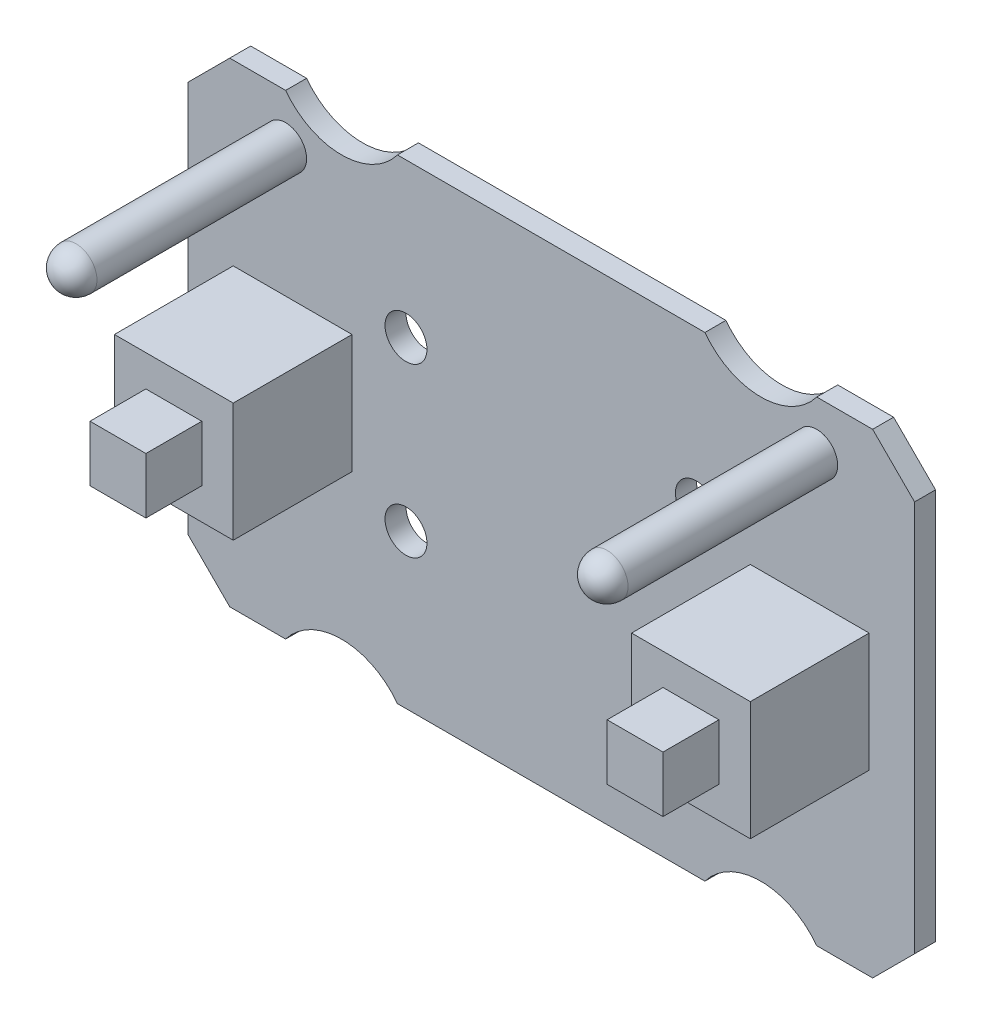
ISO-10303-21;
HEADER;
FILE_DESCRIPTION(('STEP AP214'),'2;1');
FILE_NAME('part.step','',(''),(''),'','','');
FILE_SCHEMA(('AUTOMOTIVE_DESIGN { 1 0 10303 214 1 1 1 1 }'));
ENDSEC;
DATA;
#1=APPLICATION_CONTEXT('core data for automotive mechanical design processes');
#2=APPLICATION_PROTOCOL_DEFINITION('international standard','automotive_design',2000,#1);
#3=PRODUCT_CONTEXT('',#1,'mechanical');
#4=PRODUCT('Part','Part','',(#3));
#5=PRODUCT_RELATED_PRODUCT_CATEGORY('part','',(#4));
#6=PRODUCT_DEFINITION_FORMATION('','',#4);
#7=PRODUCT_DEFINITION_CONTEXT('part definition',#1,'design');
#8=PRODUCT_DEFINITION('design','',#6,#7);
#9=PRODUCT_DEFINITION_SHAPE('','',#8);
#10=(LENGTH_UNIT() NAMED_UNIT(*) SI_UNIT(.MILLI.,.METRE.));
#11=(NAMED_UNIT(*) PLANE_ANGLE_UNIT() SI_UNIT($,.RADIAN.));
#12=(NAMED_UNIT(*) SI_UNIT($,.STERADIAN.) SOLID_ANGLE_UNIT());
#13=UNCERTAINTY_MEASURE_WITH_UNIT(LENGTH_MEASURE(1.E-05),#10,'distance_accuracy_value','');
#14=(GEOMETRIC_REPRESENTATION_CONTEXT(3) GLOBAL_UNCERTAINTY_ASSIGNED_CONTEXT((#13)) GLOBAL_UNIT_ASSIGNED_CONTEXT((#10,
#11,#12)) REPRESENTATION_CONTEXT('',''));
#15=CARTESIAN_POINT('',(0.,0.,0.));
#16=DIRECTION('',(0.,0.,1.));
#17=DIRECTION('',(1.,0.,0.));
#18=AXIS2_PLACEMENT_3D('',#15,#16,#17);
#19=CARTESIAN_POINT('',(-26.,-17.,0.));
#20=DIRECTION('',(0.,0.,1.));
#21=DIRECTION('',(1.,0.,0.));
#22=AXIS2_PLACEMENT_3D('',#19,#20,#21);
#23=PLANE('',#22);
#24=CARTESIAN_POINT('',(-22.5,-12.5,0.));
#25=DIRECTION('',(0.,0.,1.));
#26=DIRECTION('',(1.,0.,0.));
#27=AXIS2_PLACEMENT_3D('',#24,#25,#26);
#28=CIRCLE('',#27,0.3);
#29=CARTESIAN_POINT('',(-22.2,-12.5,0.));
#30=VERTEX_POINT('',#29);
#31=EDGE_CURVE('E504',#30,#30,#28,.F.);
#32=ORIENTED_EDGE('',*,*,#31,.F.);
#33=EDGE_LOOP('',(#32));
#34=FACE_BOUND('',#33,.T.);
#35=CARTESIAN_POINT('',(10.39,6.,0.));
#36=DIRECTION('',(0.,0.,1.));
#37=DIRECTION('',(1.,0.,0.));
#38=AXIS2_PLACEMENT_3D('',#35,#36,#37);
#39=CIRCLE('',#38,1.5);
#40=CARTESIAN_POINT('',(11.89,6.,0.));
#41=VERTEX_POINT('',#40);
#42=EDGE_CURVE('E1043',#41,#41,#39,.T.);
#43=ORIENTED_EDGE('',*,*,#42,.T.);
#44=EDGE_LOOP('',(#43));
#45=FACE_BOUND('',#44,.T.);
#46=CARTESIAN_POINT('',(-10.39,6.,0.));
#47=DIRECTION('',(0.,0.,1.));
#48=DIRECTION('',(1.,0.,0.));
#49=AXIS2_PLACEMENT_3D('',#46,#47,#48);
#50=CIRCLE('',#49,1.5);
#51=CARTESIAN_POINT('',(-8.89,6.,0.));
#52=VERTEX_POINT('',#51);
#53=EDGE_CURVE('E258',#52,#52,#50,.T.);
#54=ORIENTED_EDGE('',*,*,#53,.T.);
#55=EDGE_LOOP('',(#54));
#56=FACE_BOUND('',#55,.T.);
#57=DIRECTION('',(1.,0.,0.));
#58=VECTOR('',#57,1.);
#59=CARTESIAN_POINT('',(-26.,-17.,0.));
#60=LINE('',#59,#58);
#61=CARTESIAN_POINT('',(19.,-17.,0.));
#62=VERTEX_POINT('',#61);
#63=CARTESIAN_POINT('',(23.,-17.,0.));
#64=VERTEX_POINT('',#63);
#65=EDGE_CURVE('E417',#62,#64,#60,.T.);
#66=ORIENTED_EDGE('',*,*,#65,.F.);
#67=CARTESIAN_POINT('',(15.,-20.,0.));
#68=DIRECTION('',(0.,0.,1.));
#69=DIRECTION('',(1.,0.,0.));
#70=AXIS2_PLACEMENT_3D('',#67,#68,#69);
#71=CIRCLE('',#70,5.);
#72=CARTESIAN_POINT('',(11.,-17.,0.));
#73=VERTEX_POINT('',#72);
#74=EDGE_CURVE('E371',#62,#73,#71,.T.);
#75=ORIENTED_EDGE('',*,*,#74,.T.);
#76=CARTESIAN_POINT('',(-11.,-17.,0.));
#77=VERTEX_POINT('',#76);
#78=EDGE_CURVE('E422',#77,#73,#60,.T.);
#79=ORIENTED_EDGE('',*,*,#78,.F.);
#80=CARTESIAN_POINT('',(-15.,-20.,0.));
#81=DIRECTION('',(0.,0.,1.));
#82=DIRECTION('',(1.,0.,0.));
#83=AXIS2_PLACEMENT_3D('',#80,#81,#82);
#84=CIRCLE('',#83,5.);
#85=CARTESIAN_POINT('',(-19.,-17.,0.));
#86=VERTEX_POINT('',#85);
#87=EDGE_CURVE('E382',#77,#86,#84,.T.);
#88=ORIENTED_EDGE('',*,*,#87,.T.);
#89=CARTESIAN_POINT('',(-23.,-17.,0.));
#90=VERTEX_POINT('',#89);
#91=EDGE_CURVE('E418',#90,#86,#60,.T.);
#92=ORIENTED_EDGE('',*,*,#91,.F.);
#93=DIRECTION('',(0.707106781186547,-0.707106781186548,0.));
#94=VECTOR('',#93,1.);
#95=CARTESIAN_POINT('',(-23.,-17.,0.));
#96=LINE('',#95,#94);
#97=CARTESIAN_POINT('',(-26.,-14.,0.));
#98=VERTEX_POINT('',#97);
#99=EDGE_CURVE('E460',#90,#98,#96,.F.);
#100=ORIENTED_EDGE('',*,*,#99,.T.);
#101=DIRECTION('',(0.,-1.,0.));
#102=VECTOR('',#101,1.);
#103=CARTESIAN_POINT('',(-26.,17.,0.));
#104=LINE('',#103,#102);
#105=CARTESIAN_POINT('',(-26.,14.,0.));
#106=VERTEX_POINT('',#105);
#107=EDGE_CURVE('E414',#106,#98,#104,.T.);
#108=ORIENTED_EDGE('',*,*,#107,.F.);
#109=DIRECTION('',(-0.707106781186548,-0.707106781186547,0.));
#110=VECTOR('',#109,1.);
#111=CARTESIAN_POINT('',(-26.,14.,0.));
#112=LINE('',#111,#110);
#113=CARTESIAN_POINT('',(-23.,17.,0.));
#114=VERTEX_POINT('',#113);
#115=EDGE_CURVE('E457',#106,#114,#112,.F.);
#116=ORIENTED_EDGE('',*,*,#115,.T.);
#117=DIRECTION('',(-1.,0.,0.));
#118=VECTOR('',#117,1.);
#119=CARTESIAN_POINT('',(-26.,17.,0.));
#120=LINE('',#119,#118);
#121=CARTESIAN_POINT('',(-19.,17.,0.));
#122=VERTEX_POINT('',#121);
#123=EDGE_CURVE('E425',#122,#114,#120,.T.);
#124=ORIENTED_EDGE('',*,*,#123,.F.);
#125=CARTESIAN_POINT('',(-15.,20.,0.));
#126=DIRECTION('',(0.,0.,1.));
#127=DIRECTION('',(1.,0.,0.));
#128=AXIS2_PLACEMENT_3D('',#125,#126,#127);
#129=CIRCLE('',#128,5.);
#130=CARTESIAN_POINT('',(-11.,17.,0.));
#131=VERTEX_POINT('',#130);
#132=EDGE_CURVE('E405',#122,#131,#129,.T.);
#133=ORIENTED_EDGE('',*,*,#132,.T.);
#134=CARTESIAN_POINT('',(11.,17.,0.));
#135=VERTEX_POINT('',#134);
#136=EDGE_CURVE('E430',#135,#131,#120,.T.);
#137=ORIENTED_EDGE('',*,*,#136,.F.);
#138=CARTESIAN_POINT('',(15.,20.,0.));
#139=DIRECTION('',(0.,0.,1.));
#140=DIRECTION('',(1.,0.,0.));
#141=AXIS2_PLACEMENT_3D('',#138,#139,#140);
#142=CIRCLE('',#141,5.);
#143=CARTESIAN_POINT('',(19.,17.,0.));
#144=VERTEX_POINT('',#143);
#145=EDGE_CURVE('E393',#135,#144,#142,.T.);
#146=ORIENTED_EDGE('',*,*,#145,.T.);
#147=CARTESIAN_POINT('',(23.,17.,0.));
#148=VERTEX_POINT('',#147);
#149=EDGE_CURVE('E426',#148,#144,#120,.T.);
#150=ORIENTED_EDGE('',*,*,#149,.F.);
#151=DIRECTION('',(-0.707106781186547,0.707106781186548,0.));
#152=VECTOR('',#151,1.);
#153=CARTESIAN_POINT('',(23.,17.,0.));
#154=LINE('',#153,#152);
#155=CARTESIAN_POINT('',(26.,14.,0.));
#156=VERTEX_POINT('',#155);
#157=EDGE_CURVE('E452',#148,#156,#154,.F.);
#158=ORIENTED_EDGE('',*,*,#157,.T.);
#159=DIRECTION('',(0.,1.,0.));
#160=VECTOR('',#159,1.);
#161=CARTESIAN_POINT('',(26.,17.,0.));
#162=LINE('',#161,#160);
#163=CARTESIAN_POINT('',(26.,-14.,0.));
#164=VERTEX_POINT('',#163);
#165=EDGE_CURVE('E421',#164,#156,#162,.T.);
#166=ORIENTED_EDGE('',*,*,#165,.F.);
#167=DIRECTION('',(0.707106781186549,0.707106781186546,0.));
#168=VECTOR('',#167,1.);
#169=CARTESIAN_POINT('',(26.,-14.,0.));
#170=LINE('',#169,#168);
#171=EDGE_CURVE('E454',#164,#64,#170,.F.);
#172=ORIENTED_EDGE('',*,*,#171,.T.);
#173=EDGE_LOOP('',(#66,#75,#79,#88,#92,#100,#108,#116,#124,#133,#137,#146,#150,#158,#166,#172));
#174=FACE_BOUND('',#173,.T.);
#175=CARTESIAN_POINT('',(-10.39,-6.,0.));
#176=DIRECTION('',(0.,0.,1.));
#177=DIRECTION('',(1.,0.,0.));
#178=AXIS2_PLACEMENT_3D('',#175,#176,#177);
#179=CIRCLE('',#178,1.5);
#180=CARTESIAN_POINT('',(-8.89,-6.,0.));
#181=VERTEX_POINT('',#180);
#182=EDGE_CURVE('E492',#181,#181,#179,.T.);
#183=ORIENTED_EDGE('',*,*,#182,.T.);
#184=EDGE_LOOP('',(#183));
#185=FACE_BOUND('',#184,.T.);
#186=CARTESIAN_POINT('',(10.39,-6.,0.));
#187=DIRECTION('',(0.,0.,1.));
#188=DIRECTION('',(1.,0.,0.));
#189=AXIS2_PLACEMENT_3D('',#186,#187,#188);
#190=CIRCLE('',#189,1.5);
#191=CARTESIAN_POINT('',(11.89,-6.,0.));
#192=VERTEX_POINT('',#191);
#193=EDGE_CURVE('E498',#192,#192,#190,.T.);
#194=ORIENTED_EDGE('',*,*,#193,.T.);
#195=EDGE_LOOP('',(#194));
#196=FACE_BOUND('',#195,.T.);
#197=CARTESIAN_POINT('',(-22.5,-10.5,0.));
#198=DIRECTION('',(0.,0.,1.));
#199=DIRECTION('',(1.,0.,0.));
#200=AXIS2_PLACEMENT_3D('',#197,#198,#199);
#201=CIRCLE('',#200,0.3);
#202=CARTESIAN_POINT('',(-22.2,-10.5,0.));
#203=VERTEX_POINT('',#202);
#204=EDGE_CURVE('E507',#203,#203,#201,.F.);
#205=ORIENTED_EDGE('',*,*,#204,.F.);
#206=EDGE_LOOP('',(#205));
#207=FACE_BOUND('',#206,.T.);
#208=CARTESIAN_POINT('',(-22.5,-8.5,0.));
#209=DIRECTION('',(0.,0.,1.));
#210=DIRECTION('',(1.,0.,0.));
#211=AXIS2_PLACEMENT_3D('',#208,#209,#210);
#212=CIRCLE('',#211,0.3);
#213=CARTESIAN_POINT('',(-22.2,-8.5,0.));
#214=VERTEX_POINT('',#213);
#215=EDGE_CURVE('E510',#214,#214,#212,.F.);
#216=ORIENTED_EDGE('',*,*,#215,.F.);
#217=EDGE_LOOP('',(#216));
#218=FACE_BOUND('',#217,.T.);
#219=CARTESIAN_POINT('',(-22.5,-6.5,0.));
#220=DIRECTION('',(0.,0.,1.));
#221=DIRECTION('',(1.,0.,0.));
#222=AXIS2_PLACEMENT_3D('',#219,#220,#221);
#223=CIRCLE('',#222,0.3);
#224=CARTESIAN_POINT('',(-22.2,-6.5,0.));
#225=VERTEX_POINT('',#224);
#226=EDGE_CURVE('E34',#225,#225,#223,.F.);
#227=ORIENTED_EDGE('',*,*,#226,.F.);
#228=EDGE_LOOP('',(#227));
#229=FACE_BOUND('',#228,.T.);
#230=ADVANCED_FACE('F26',(#34,#45,#56,#174,#185,#196,#207,#218,#229),#23,.F.);
#231=CARTESIAN_POINT('',(14.25,-4.25,10.));
#232=DIRECTION('',(0.,0.,1.));
#233=DIRECTION('',(1.,0.,0.));
#234=AXIS2_PLACEMENT_3D('',#231,#232,#233);
#235=PLANE('',#234);
#236=DIRECTION('',(0.,-1.,0.));
#237=VECTOR('',#236,1.);
#238=CARTESIAN_POINT('',(14.25,4.25,10.));
#239=LINE('',#238,#237);
#240=CARTESIAN_POINT('',(14.25,4.25,10.));
#241=VERTEX_POINT('',#240);
#242=CARTESIAN_POINT('',(14.25,-4.25,10.));
#243=VERTEX_POINT('',#242);
#244=EDGE_CURVE('E287',#241,#243,#239,.T.);
#245=ORIENTED_EDGE('',*,*,#244,.T.);
#246=DIRECTION('',(1.,0.,0.));
#247=VECTOR('',#246,1.);
#248=CARTESIAN_POINT('',(14.25,-4.25,10.));
#249=LINE('',#248,#247);
#250=CARTESIAN_POINT('',(22.75,-4.25,10.));
#251=VERTEX_POINT('',#250);
#252=EDGE_CURVE('E290',#243,#251,#249,.T.);
#253=ORIENTED_EDGE('',*,*,#252,.T.);
#254=DIRECTION('',(0.,1.,0.));
#255=VECTOR('',#254,1.);
#256=CARTESIAN_POINT('',(22.75,4.25,10.));
#257=LINE('',#256,#255);
#258=CARTESIAN_POINT('',(22.75,4.25,10.));
#259=VERTEX_POINT('',#258);
#260=EDGE_CURVE('E292',#251,#259,#257,.T.);
#261=ORIENTED_EDGE('',*,*,#260,.T.);
#262=DIRECTION('',(-1.,0.,0.));
#263=VECTOR('',#262,1.);
#264=CARTESIAN_POINT('',(14.25,4.25,10.));
#265=LINE('',#264,#263);
#266=EDGE_CURVE('E294',#259,#241,#265,.T.);
#267=ORIENTED_EDGE('',*,*,#266,.T.);
#268=EDGE_LOOP('',(#245,#253,#261,#267));
#269=FACE_BOUND('',#268,.T.);
#270=DIRECTION('',(1.,0.,0.));
#271=VECTOR('',#270,1.);
#272=CARTESIAN_POINT('',(16.5,-2.,10.));
#273=LINE('',#272,#271);
#274=CARTESIAN_POINT('',(16.5,-2.,10.));
#275=VERTEX_POINT('',#274);
#276=CARTESIAN_POINT('',(20.5,-2.,10.));
#277=VERTEX_POINT('',#276);
#278=EDGE_CURVE('E241',#275,#277,#273,.T.);
#279=ORIENTED_EDGE('',*,*,#278,.F.);
#280=DIRECTION('',(0.,-1.,0.));
#281=VECTOR('',#280,1.);
#282=CARTESIAN_POINT('',(16.5,2.,10.));
#283=LINE('',#282,#281);
#284=CARTESIAN_POINT('',(16.5,2.,10.));
#285=VERTEX_POINT('',#284);
#286=EDGE_CURVE('E252',#285,#275,#283,.T.);
#287=ORIENTED_EDGE('',*,*,#286,.F.);
#288=DIRECTION('',(-1.,0.,0.));
#289=VECTOR('',#288,1.);
#290=CARTESIAN_POINT('',(16.5,2.,10.));
#291=LINE('',#290,#289);
#292=CARTESIAN_POINT('',(20.5,2.,10.));
#293=VERTEX_POINT('',#292);
#294=EDGE_CURVE('E264',#293,#285,#291,.T.);
#295=ORIENTED_EDGE('',*,*,#294,.F.);
#296=DIRECTION('',(0.,1.,0.));
#297=VECTOR('',#296,1.);
#298=CARTESIAN_POINT('',(20.5,2.,10.));
#299=LINE('',#298,#297);
#300=EDGE_CURVE('E262',#277,#293,#299,.T.);
#301=ORIENTED_EDGE('',*,*,#300,.F.);
#302=EDGE_LOOP('',(#279,#287,#295,#301));
#303=FACE_BOUND('',#302,.T.);
#304=ADVANCED_FACE('F261',(#269,#303),#235,.T.);
#305=CARTESIAN_POINT('',(-26.,-17.,1.5));
#306=DIRECTION('',(0.,0.,1.));
#307=DIRECTION('',(1.,0.,0.));
#308=AXIS2_PLACEMENT_3D('',#305,#306,#307);
#309=PLANE('',#308);
#310=CARTESIAN_POINT('',(10.39,6.,1.5));
#311=DIRECTION('',(0.,0.,1.));
#312=DIRECTION('',(1.,0.,0.));
#313=AXIS2_PLACEMENT_3D('',#310,#311,#312);
#314=CIRCLE('',#313,1.5);
#315=CARTESIAN_POINT('',(11.89,6.,1.5));
#316=VERTEX_POINT('',#315);
#317=EDGE_CURVE('E1040',#316,#316,#314,.T.);
#318=ORIENTED_EDGE('',*,*,#317,.F.);
#319=EDGE_LOOP('',(#318));
#320=FACE_BOUND('',#319,.T.);
#321=CARTESIAN_POINT('',(-10.39,6.,1.5));
#322=DIRECTION('',(0.,0.,1.));
#323=DIRECTION('',(1.,0.,0.));
#324=AXIS2_PLACEMENT_3D('',#321,#322,#323);
#325=CIRCLE('',#324,1.5);
#326=CARTESIAN_POINT('',(-8.89,6.,1.5));
#327=VERTEX_POINT('',#326);
#328=EDGE_CURVE('E1038',#327,#327,#325,.T.);
#329=ORIENTED_EDGE('',*,*,#328,.F.);
#330=EDGE_LOOP('',(#329));
#331=FACE_BOUND('',#330,.T.);
#332=DIRECTION('',(1.,0.,0.));
#333=VECTOR('',#332,1.);
#334=CARTESIAN_POINT('',(-22.75,-4.25,1.5));
#335=LINE('',#334,#333);
#336=CARTESIAN_POINT('',(-22.75,-4.25,1.5));
#337=VERTEX_POINT('',#336);
#338=CARTESIAN_POINT('',(-14.25,-4.25,1.5));
#339=VERTEX_POINT('',#338);
#340=EDGE_CURVE('E337',#337,#339,#335,.T.);
#341=ORIENTED_EDGE('',*,*,#340,.F.);
#342=DIRECTION('',(0.,-1.,0.));
#343=VECTOR('',#342,1.);
#344=CARTESIAN_POINT('',(-22.75,4.25,1.5));
#345=LINE('',#344,#343);
#346=CARTESIAN_POINT('',(-22.75,4.25,1.5));
#347=VERTEX_POINT('',#346);
#348=EDGE_CURVE('E334',#347,#337,#345,.T.);
#349=ORIENTED_EDGE('',*,*,#348,.F.);
#350=DIRECTION('',(-1.,0.,0.));
#351=VECTOR('',#350,1.);
#352=CARTESIAN_POINT('',(-22.75,4.25,1.5));
#353=LINE('',#352,#351);
#354=CARTESIAN_POINT('',(-14.25,4.25,1.5));
#355=VERTEX_POINT('',#354);
#356=EDGE_CURVE('E342',#355,#347,#353,.T.);
#357=ORIENTED_EDGE('',*,*,#356,.F.);
#358=DIRECTION('',(0.,1.,0.));
#359=VECTOR('',#358,1.);
#360=CARTESIAN_POINT('',(-14.25,4.25,1.5));
#361=LINE('',#360,#359);
#362=EDGE_CURVE('E339',#339,#355,#361,.T.);
#363=ORIENTED_EDGE('',*,*,#362,.F.);
#364=EDGE_LOOP('',(#341,#349,#357,#363));
#365=FACE_BOUND('',#364,.T.);
#366=CARTESIAN_POINT('',(-19.,13.5,1.5));
#367=DIRECTION('',(0.,0.,1.));
#368=DIRECTION('',(1.,0.,0.));
#369=AXIS2_PLACEMENT_3D('',#366,#367,#368);
#370=CIRCLE('',#369,1.5);
#371=CARTESIAN_POINT('',(-17.5,13.5,1.5));
#372=VERTEX_POINT('',#371);
#373=EDGE_CURVE('E366',#372,#372,#370,.T.);
#374=ORIENTED_EDGE('',*,*,#373,.F.);
#375=EDGE_LOOP('',(#374));
#376=FACE_BOUND('',#375,.T.);
#377=CARTESIAN_POINT('',(15.,-20.,1.5));
#378=DIRECTION('',(0.,0.,1.));
#379=DIRECTION('',(1.,0.,0.));
#380=AXIS2_PLACEMENT_3D('',#377,#378,#379);
#381=CIRCLE('',#380,5.);
#382=CARTESIAN_POINT('',(19.,-17.,1.5));
#383=VERTEX_POINT('',#382);
#384=CARTESIAN_POINT('',(11.,-17.,1.5));
#385=VERTEX_POINT('',#384);
#386=EDGE_CURVE('E369',#383,#385,#381,.T.);
#387=ORIENTED_EDGE('',*,*,#386,.F.);
#388=DIRECTION('',(1.,0.,0.));
#389=VECTOR('',#388,1.);
#390=CARTESIAN_POINT('',(-26.,-17.,1.5));
#391=LINE('',#390,#389);
#392=CARTESIAN_POINT('',(23.,-17.,1.5));
#393=VERTEX_POINT('',#392);
#394=EDGE_CURVE('E433',#383,#393,#391,.T.);
#395=ORIENTED_EDGE('',*,*,#394,.T.);
#396=DIRECTION('',(-0.707106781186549,-0.707106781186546,0.));
#397=VECTOR('',#396,1.);
#398=CARTESIAN_POINT('',(-1.50000000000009,-41.5,1.5));
#399=LINE('',#398,#397);
#400=CARTESIAN_POINT('',(26.,-14.,1.5));
#401=VERTEX_POINT('',#400);
#402=EDGE_CURVE('E469',#393,#401,#399,.F.);
#403=ORIENTED_EDGE('',*,*,#402,.T.);
#404=DIRECTION('',(0.,1.,0.));
#405=VECTOR('',#404,1.);
#406=CARTESIAN_POINT('',(26.,17.,1.5));
#407=LINE('',#406,#405);
#408=CARTESIAN_POINT('',(26.,14.,1.5));
#409=VERTEX_POINT('',#408);
#410=EDGE_CURVE('E437',#401,#409,#407,.T.);
#411=ORIENTED_EDGE('',*,*,#410,.T.);
#412=DIRECTION('',(0.707106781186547,-0.707106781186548,0.));
#413=VECTOR('',#412,1.);
#414=CARTESIAN_POINT('',(15.5000000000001,24.5,1.5));
#415=LINE('',#414,#413);
#416=CARTESIAN_POINT('',(23.,17.,1.5));
#417=VERTEX_POINT('',#416);
#418=EDGE_CURVE('E467',#409,#417,#415,.F.);
#419=ORIENTED_EDGE('',*,*,#418,.T.);
#420=DIRECTION('',(-1.,0.,0.));
#421=VECTOR('',#420,1.);
#422=CARTESIAN_POINT('',(-26.,17.,1.5));
#423=LINE('',#422,#421);
#424=CARTESIAN_POINT('',(19.,17.,1.5));
#425=VERTEX_POINT('',#424);
#426=EDGE_CURVE('E442',#417,#425,#423,.T.);
#427=ORIENTED_EDGE('',*,*,#426,.T.);
#428=CARTESIAN_POINT('',(15.,20.,1.5));
#429=DIRECTION('',(0.,0.,1.));
#430=DIRECTION('',(1.,0.,0.));
#431=AXIS2_PLACEMENT_3D('',#428,#429,#430);
#432=CIRCLE('',#431,5.);
#433=CARTESIAN_POINT('',(11.,17.,1.5));
#434=VERTEX_POINT('',#433);
#435=EDGE_CURVE('E391',#434,#425,#432,.T.);
#436=ORIENTED_EDGE('',*,*,#435,.F.);
#437=CARTESIAN_POINT('',(-11.,17.,1.5));
#438=VERTEX_POINT('',#437);
#439=EDGE_CURVE('E446',#434,#438,#423,.T.);
#440=ORIENTED_EDGE('',*,*,#439,.T.);
#441=CARTESIAN_POINT('',(-15.,20.,1.5));
#442=DIRECTION('',(0.,0.,1.));
#443=DIRECTION('',(1.,0.,0.));
#444=AXIS2_PLACEMENT_3D('',#441,#442,#443);
#445=CIRCLE('',#444,5.);
#446=CARTESIAN_POINT('',(-19.,17.,1.5));
#447=VERTEX_POINT('',#446);
#448=EDGE_CURVE('E402',#447,#438,#445,.T.);
#449=ORIENTED_EDGE('',*,*,#448,.F.);
#450=CARTESIAN_POINT('',(-23.,17.,1.5));
#451=VERTEX_POINT('',#450);
#452=EDGE_CURVE('E441',#447,#451,#423,.T.);
#453=ORIENTED_EDGE('',*,*,#452,.T.);
#454=DIRECTION('',(0.707106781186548,0.707106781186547,0.));
#455=VECTOR('',#454,1.);
#456=CARTESIAN_POINT('',(-41.5,-1.49999999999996,1.5));
#457=LINE('',#456,#455);
#458=CARTESIAN_POINT('',(-26.,14.,1.5));
#459=VERTEX_POINT('',#458);
#460=EDGE_CURVE('E471',#451,#459,#457,.F.);
#461=ORIENTED_EDGE('',*,*,#460,.T.);
#462=DIRECTION('',(0.,-1.,0.));
#463=VECTOR('',#462,1.);
#464=CARTESIAN_POINT('',(-26.,17.,1.5));
#465=LINE('',#464,#463);
#466=CARTESIAN_POINT('',(-26.,-14.,1.5));
#467=VERTEX_POINT('',#466);
#468=EDGE_CURVE('E429',#459,#467,#465,.T.);
#469=ORIENTED_EDGE('',*,*,#468,.T.);
#470=DIRECTION('',(-0.707106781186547,0.707106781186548,0.));
#471=VECTOR('',#470,1.);
#472=CARTESIAN_POINT('',(-24.5,-15.5,1.5));
#473=LINE('',#472,#471);
#474=CARTESIAN_POINT('',(-23.,-17.,1.5));
#475=VERTEX_POINT('',#474);
#476=EDGE_CURVE('E473',#467,#475,#473,.F.);
#477=ORIENTED_EDGE('',*,*,#476,.T.);
#478=CARTESIAN_POINT('',(-19.,-17.,1.5));
#479=VERTEX_POINT('',#478);
#480=EDGE_CURVE('E434',#475,#479,#391,.T.);
#481=ORIENTED_EDGE('',*,*,#480,.T.);
#482=CARTESIAN_POINT('',(-15.,-20.,1.5));
#483=DIRECTION('',(0.,0.,1.));
#484=DIRECTION('',(1.,0.,0.));
#485=AXIS2_PLACEMENT_3D('',#482,#483,#484);
#486=CIRCLE('',#485,5.);
#487=CARTESIAN_POINT('',(-11.,-17.,1.5));
#488=VERTEX_POINT('',#487);
#489=EDGE_CURVE('E380',#488,#479,#486,.T.);
#490=ORIENTED_EDGE('',*,*,#489,.F.);
#491=EDGE_CURVE('E438',#488,#385,#391,.T.);
#492=ORIENTED_EDGE('',*,*,#491,.T.);
#493=EDGE_LOOP('',(#387,#395,#403,#411,#419,#427,#436,#440,#449,#453,#461,#469,#477,#481,#490,#492));
#494=FACE_BOUND('',#493,.T.);
#495=CARTESIAN_POINT('',(19.,13.5,1.5));
#496=DIRECTION('',(0.,0.,1.));
#497=DIRECTION('',(1.,0.,0.));
#498=AXIS2_PLACEMENT_3D('',#495,#496,#497);
#499=CIRCLE('',#498,1.5);
#500=CARTESIAN_POINT('',(20.5,13.5,1.5));
#501=VERTEX_POINT('',#500);
#502=EDGE_CURVE('E363',#501,#501,#499,.T.);
#503=ORIENTED_EDGE('',*,*,#502,.F.);
#504=EDGE_LOOP('',(#503));
#505=FACE_BOUND('',#504,.T.);
#506=DIRECTION('',(1.,0.,0.));
#507=VECTOR('',#506,1.);
#508=CARTESIAN_POINT('',(14.25,-4.25,1.5));
#509=LINE('',#508,#507);
#510=CARTESIAN_POINT('',(14.25,-4.25,1.5));
#511=VERTEX_POINT('',#510);
#512=CARTESIAN_POINT('',(22.75,-4.25,1.5));
#513=VERTEX_POINT('',#512);
#514=EDGE_CURVE('E281',#511,#513,#509,.T.);
#515=ORIENTED_EDGE('',*,*,#514,.F.);
#516=DIRECTION('',(0.,-1.,0.));
#517=VECTOR('',#516,1.);
#518=CARTESIAN_POINT('',(14.25,4.25,1.5));
#519=LINE('',#518,#517);
#520=CARTESIAN_POINT('',(14.25,4.25,1.5));
#521=VERTEX_POINT('',#520);
#522=EDGE_CURVE('E247',#521,#511,#519,.T.);
#523=ORIENTED_EDGE('',*,*,#522,.F.);
#524=DIRECTION('',(-1.,0.,0.));
#525=VECTOR('',#524,1.);
#526=CARTESIAN_POINT('',(14.25,4.25,1.5));
#527=LINE('',#526,#525);
#528=CARTESIAN_POINT('',(22.75,4.25,1.5));
#529=VERTEX_POINT('',#528);
#530=EDGE_CURVE('E285',#529,#521,#527,.T.);
#531=ORIENTED_EDGE('',*,*,#530,.F.);
#532=DIRECTION('',(0.,1.,0.));
#533=VECTOR('',#532,1.);
#534=CARTESIAN_POINT('',(22.75,4.25,1.5));
#535=LINE('',#534,#533);
#536=EDGE_CURVE('E283',#513,#529,#535,.T.);
#537=ORIENTED_EDGE('',*,*,#536,.F.);
#538=EDGE_LOOP('',(#515,#523,#531,#537));
#539=FACE_BOUND('',#538,.T.);
#540=CARTESIAN_POINT('',(-10.39,-6.,1.5));
#541=DIRECTION('',(0.,0.,1.));
#542=DIRECTION('',(1.,0.,0.));
#543=AXIS2_PLACEMENT_3D('',#540,#541,#542);
#544=CIRCLE('',#543,1.5);
#545=CARTESIAN_POINT('',(-8.89,-6.,1.5));
#546=VERTEX_POINT('',#545);
#547=EDGE_CURVE('E495',#546,#546,#544,.T.);
#548=ORIENTED_EDGE('',*,*,#547,.F.);
#549=EDGE_LOOP('',(#548));
#550=FACE_BOUND('',#549,.T.);
#551=CARTESIAN_POINT('',(10.39,-6.,1.5));
#552=DIRECTION('',(0.,0.,1.));
#553=DIRECTION('',(1.,0.,0.));
#554=AXIS2_PLACEMENT_3D('',#551,#552,#553);
#555=CIRCLE('',#554,1.5);
#556=CARTESIAN_POINT('',(11.89,-6.,1.5));
#557=VERTEX_POINT('',#556);
#558=EDGE_CURVE('E501',#557,#557,#555,.T.);
#559=ORIENTED_EDGE('',*,*,#558,.F.);
#560=EDGE_LOOP('',(#559));
#561=FACE_BOUND('',#560,.T.);
#562=ADVANCED_FACE('F528',(#320,#331,#365,#376,#494,#505,#539,#550,#561),#309,.T.);
#563=CARTESIAN_POINT('',(-22.75,-4.25,10.));
#564=DIRECTION('',(0.,0.,1.));
#565=DIRECTION('',(1.,0.,0.));
#566=AXIS2_PLACEMENT_3D('',#563,#564,#565);
#567=PLANE('',#566);
#568=DIRECTION('',(0.,-1.,0.));
#569=VECTOR('',#568,1.);
#570=CARTESIAN_POINT('',(-22.75,4.25,10.));
#571=LINE('',#570,#569);
#572=CARTESIAN_POINT('',(-22.75,4.25,10.));
#573=VERTEX_POINT('',#572);
#574=CARTESIAN_POINT('',(-22.75,-4.25,10.));
#575=VERTEX_POINT('',#574);
#576=EDGE_CURVE('E344',#573,#575,#571,.T.);
#577=ORIENTED_EDGE('',*,*,#576,.T.);
#578=DIRECTION('',(1.,0.,0.));
#579=VECTOR('',#578,1.);
#580=CARTESIAN_POINT('',(-22.75,-4.25,10.));
#581=LINE('',#580,#579);
#582=CARTESIAN_POINT('',(-14.25,-4.25,10.));
#583=VERTEX_POINT('',#582);
#584=EDGE_CURVE('E347',#575,#583,#581,.T.);
#585=ORIENTED_EDGE('',*,*,#584,.T.);
#586=DIRECTION('',(0.,1.,0.));
#587=VECTOR('',#586,1.);
#588=CARTESIAN_POINT('',(-14.25,4.25,10.));
#589=LINE('',#588,#587);
#590=CARTESIAN_POINT('',(-14.25,4.25,10.));
#591=VERTEX_POINT('',#590);
#592=EDGE_CURVE('E349',#583,#591,#589,.T.);
#593=ORIENTED_EDGE('',*,*,#592,.T.);
#594=DIRECTION('',(-1.,0.,0.));
#595=VECTOR('',#594,1.);
#596=CARTESIAN_POINT('',(-22.75,4.25,10.));
#597=LINE('',#596,#595);
#598=EDGE_CURVE('E351',#591,#573,#597,.T.);
#599=ORIENTED_EDGE('',*,*,#598,.T.);
#600=EDGE_LOOP('',(#577,#585,#593,#599));
#601=FACE_BOUND('',#600,.T.);
#602=DIRECTION('',(1.,0.,0.));
#603=VECTOR('',#602,1.);
#604=CARTESIAN_POINT('',(-20.5,-2.,10.));
#605=LINE('',#604,#603);
#606=CARTESIAN_POINT('',(-20.5,-2.,10.));
#607=VERTEX_POINT('',#606);
#608=CARTESIAN_POINT('',(-16.5,-2.,10.));
#609=VERTEX_POINT('',#608);
#610=EDGE_CURVE('E308',#607,#609,#605,.T.);
#611=ORIENTED_EDGE('',*,*,#610,.F.);
#612=DIRECTION('',(0.,-1.,0.));
#613=VECTOR('',#612,1.);
#614=CARTESIAN_POINT('',(-20.5,2.,10.));
#615=LINE('',#614,#613);
#616=CARTESIAN_POINT('',(-20.5,2.,10.));
#617=VERTEX_POINT('',#616);
#618=EDGE_CURVE('E305',#617,#607,#615,.T.);
#619=ORIENTED_EDGE('',*,*,#618,.F.);
#620=DIRECTION('',(-1.,0.,0.));
#621=VECTOR('',#620,1.);
#622=CARTESIAN_POINT('',(-20.5,2.,10.));
#623=LINE('',#622,#621);
#624=CARTESIAN_POINT('',(-16.5,2.,10.));
#625=VERTEX_POINT('',#624);
#626=EDGE_CURVE('E313',#625,#617,#623,.T.);
#627=ORIENTED_EDGE('',*,*,#626,.F.);
#628=DIRECTION('',(0.,1.,0.));
#629=VECTOR('',#628,1.);
#630=CARTESIAN_POINT('',(-16.5,2.,10.));
#631=LINE('',#630,#629);
#632=EDGE_CURVE('E310',#609,#625,#631,.T.);
#633=ORIENTED_EDGE('',*,*,#632,.F.);
#634=EDGE_LOOP('',(#611,#619,#627,#633));
#635=FACE_BOUND('',#634,.T.);
#636=ADVANCED_FACE('F539',(#601,#635),#567,.T.);
#637=CARTESIAN_POINT('',(-26.,-17.,1.5));
#638=DIRECTION('',(0.,1.,0.));
#639=DIRECTION('',(0.,0.,1.));
#640=AXIS2_PLACEMENT_3D('',#637,#638,#639);
#641=PLANE('',#640);
#642=ORIENTED_EDGE('',*,*,#78,.T.);
#643=DIRECTION('',(0.,0.,1.));
#644=VECTOR('',#643,1.);
#645=CARTESIAN_POINT('',(11.,-17.,0.));
#646=LINE('',#645,#644);
#647=EDGE_CURVE('E377',#73,#385,#646,.T.);
#648=ORIENTED_EDGE('',*,*,#647,.T.);
#649=ORIENTED_EDGE('',*,*,#491,.F.);
#650=DIRECTION('',(0.,0.,1.));
#651=VECTOR('',#650,1.);
#652=CARTESIAN_POINT('',(-11.,-17.,0.));
#653=LINE('',#652,#651);
#654=EDGE_CURVE('E385',#488,#77,#653,.F.);
#655=ORIENTED_EDGE('',*,*,#654,.T.);
#656=EDGE_LOOP('',(#642,#648,#649,#655));
#657=FACE_BOUND('',#656,.T.);
#658=ADVANCED_FACE('F556',(#657),#641,.F.);
#659=ORIENTED_EDGE('',*,*,#91,.T.);
#660=DIRECTION('',(0.,0.,1.));
#661=VECTOR('',#660,1.);
#662=CARTESIAN_POINT('',(-19.,-17.,0.));
#663=LINE('',#662,#661);
#664=EDGE_CURVE('E388',#86,#479,#663,.T.);
#665=ORIENTED_EDGE('',*,*,#664,.T.);
#666=ORIENTED_EDGE('',*,*,#480,.F.);
#667=DIRECTION('',(0.,0.,-1.));
#668=VECTOR('',#667,1.);
#669=CARTESIAN_POINT('',(-23.,-17.,1.5));
#670=LINE('',#669,#668);
#671=EDGE_CURVE('E449',#475,#90,#670,.T.);
#672=ORIENTED_EDGE('',*,*,#671,.T.);
#673=EDGE_LOOP('',(#659,#665,#666,#672));
#674=FACE_BOUND('',#673,.T.);
#675=ADVANCED_FACE('F557',(#674),#641,.F.);
#676=CARTESIAN_POINT('',(-26.,17.,1.5));
#677=DIRECTION('',(0.,-1.,0.));
#678=DIRECTION('',(0.,0.,-1.));
#679=AXIS2_PLACEMENT_3D('',#676,#677,#678);
#680=PLANE('',#679);
#681=ORIENTED_EDGE('',*,*,#149,.T.);
#682=DIRECTION('',(0.,0.,1.));
#683=VECTOR('',#682,1.);
#684=CARTESIAN_POINT('',(19.,17.,0.));
#685=LINE('',#684,#683);
#686=EDGE_CURVE('E399',#144,#425,#685,.T.);
#687=ORIENTED_EDGE('',*,*,#686,.T.);
#688=ORIENTED_EDGE('',*,*,#426,.F.);
#689=DIRECTION('',(0.,0.,-1.));
#690=VECTOR('',#689,1.);
#691=CARTESIAN_POINT('',(23.,17.,1.5));
#692=LINE('',#691,#690);
#693=EDGE_CURVE('E475',#417,#148,#692,.T.);
#694=ORIENTED_EDGE('',*,*,#693,.T.);
#695=EDGE_LOOP('',(#681,#687,#688,#694));
#696=FACE_BOUND('',#695,.T.);
#697=ADVANCED_FACE('F546',(#696),#680,.F.);
#698=ORIENTED_EDGE('',*,*,#439,.F.);
#699=DIRECTION('',(0.,0.,1.));
#700=VECTOR('',#699,1.);
#701=CARTESIAN_POINT('',(11.,17.,0.));
#702=LINE('',#701,#700);
#703=EDGE_CURVE('E396',#434,#135,#702,.F.);
#704=ORIENTED_EDGE('',*,*,#703,.T.);
#705=ORIENTED_EDGE('',*,*,#136,.T.);
#706=DIRECTION('',(0.,0.,1.));
#707=VECTOR('',#706,1.);
#708=CARTESIAN_POINT('',(-11.,17.,0.));
#709=LINE('',#708,#707);
#710=EDGE_CURVE('E411',#131,#438,#709,.T.);
#711=ORIENTED_EDGE('',*,*,#710,.T.);
#712=EDGE_LOOP('',(#698,#704,#705,#711));
#713=FACE_BOUND('',#712,.T.);
#714=ADVANCED_FACE('F547',(#713),#680,.F.);
#715=CARTESIAN_POINT('',(-26.,17.,1.5));
#716=DIRECTION('',(1.,0.,0.));
#717=DIRECTION('',(0.,0.,-1.));
#718=AXIS2_PLACEMENT_3D('',#715,#716,#717);
#719=PLANE('',#718);
#720=ORIENTED_EDGE('',*,*,#107,.T.);
#721=DIRECTION('',(0.,0.,1.));
#722=VECTOR('',#721,1.);
#723=CARTESIAN_POINT('',(-26.,-14.,1.5));
#724=LINE('',#723,#722);
#725=EDGE_CURVE('E465',#98,#467,#724,.T.);
#726=ORIENTED_EDGE('',*,*,#725,.T.);
#727=ORIENTED_EDGE('',*,*,#468,.F.);
#728=DIRECTION('',(0.,0.,-1.));
#729=VECTOR('',#728,1.);
#730=CARTESIAN_POINT('',(-26.,14.,1.5));
#731=LINE('',#730,#729);
#732=EDGE_CURVE('E462',#459,#106,#731,.T.);
#733=ORIENTED_EDGE('',*,*,#732,.T.);
#734=EDGE_LOOP('',(#720,#726,#727,#733));
#735=FACE_BOUND('',#734,.T.);
#736=ADVANCED_FACE('F554',(#735),#719,.F.);
#737=ORIENTED_EDGE('',*,*,#394,.F.);
#738=DIRECTION('',(0.,0.,1.));
#739=VECTOR('',#738,1.);
#740=CARTESIAN_POINT('',(19.,-17.,0.));
#741=LINE('',#740,#739);
#742=EDGE_CURVE('E374',#383,#62,#741,.F.);
#743=ORIENTED_EDGE('',*,*,#742,.T.);
#744=ORIENTED_EDGE('',*,*,#65,.T.);
#745=DIRECTION('',(0.,0.,1.));
#746=VECTOR('',#745,1.);
#747=CARTESIAN_POINT('',(23.,-17.,1.5));
#748=LINE('',#747,#746);
#749=EDGE_CURVE('E445',#64,#393,#748,.T.);
#750=ORIENTED_EDGE('',*,*,#749,.T.);
#751=EDGE_LOOP('',(#737,#743,#744,#750));
#752=FACE_BOUND('',#751,.T.);
#753=ADVANCED_FACE('F550',(#752),#641,.F.);
#754=CARTESIAN_POINT('',(26.,17.,1.5));
#755=DIRECTION('',(-1.,0.,0.));
#756=DIRECTION('',(0.,-1.,0.));
#757=AXIS2_PLACEMENT_3D('',#754,#755,#756);
#758=PLANE('',#757);
#759=ORIENTED_EDGE('',*,*,#410,.F.);
#760=DIRECTION('',(0.,0.,-1.));
#761=VECTOR('',#760,1.);
#762=CARTESIAN_POINT('',(26.,-14.,1.5));
#763=LINE('',#762,#761);
#764=EDGE_CURVE('E483',#401,#164,#763,.T.);
#765=ORIENTED_EDGE('',*,*,#764,.T.);
#766=ORIENTED_EDGE('',*,*,#165,.T.);
#767=DIRECTION('',(0.,0.,1.));
#768=VECTOR('',#767,1.);
#769=CARTESIAN_POINT('',(26.,14.,1.5));
#770=LINE('',#769,#768);
#771=EDGE_CURVE('E481',#156,#409,#770,.T.);
#772=ORIENTED_EDGE('',*,*,#771,.T.);
#773=EDGE_LOOP('',(#759,#765,#766,#772));
#774=FACE_BOUND('',#773,.T.);
#775=ADVANCED_FACE('F544',(#774),#758,.F.);
#776=ORIENTED_EDGE('',*,*,#452,.F.);
#777=DIRECTION('',(0.,0.,1.));
#778=VECTOR('',#777,1.);
#779=CARTESIAN_POINT('',(-19.,17.,0.));
#780=LINE('',#779,#778);
#781=EDGE_CURVE('E408',#447,#122,#780,.F.);
#782=ORIENTED_EDGE('',*,*,#781,.T.);
#783=ORIENTED_EDGE('',*,*,#123,.T.);
#784=DIRECTION('',(0.,0.,1.));
#785=VECTOR('',#784,1.);
#786=CARTESIAN_POINT('',(-23.,17.,1.5));
#787=LINE('',#786,#785);
#788=EDGE_CURVE('E478',#114,#451,#787,.T.);
#789=ORIENTED_EDGE('',*,*,#788,.T.);
#790=EDGE_LOOP('',(#776,#782,#783,#789));
#791=FACE_BOUND('',#790,.T.);
#792=ADVANCED_FACE('F541',(#791),#680,.F.);
#793=CARTESIAN_POINT('',(-23.,-17.,1.5));
#794=DIRECTION('',(0.707106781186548,0.707106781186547,0.));
#795=DIRECTION('',(-0.707106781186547,0.707106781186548,0.));
#796=AXIS2_PLACEMENT_3D('',#793,#794,#795);
#797=PLANE('',#796);
#798=ORIENTED_EDGE('',*,*,#476,.F.);
#799=ORIENTED_EDGE('',*,*,#725,.F.);
#800=ORIENTED_EDGE('',*,*,#99,.F.);
#801=ORIENTED_EDGE('',*,*,#671,.F.);
#802=EDGE_LOOP('',(#798,#799,#800,#801));
#803=FACE_BOUND('',#802,.T.);
#804=ADVANCED_FACE('F535',(#803),#797,.F.);
#805=CARTESIAN_POINT('',(-26.,14.,1.5));
#806=DIRECTION('',(0.707106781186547,-0.707106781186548,0.));
#807=DIRECTION('',(0.707106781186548,0.707106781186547,0.));
#808=AXIS2_PLACEMENT_3D('',#805,#806,#807);
#809=PLANE('',#808);
#810=ORIENTED_EDGE('',*,*,#460,.F.);
#811=ORIENTED_EDGE('',*,*,#788,.F.);
#812=ORIENTED_EDGE('',*,*,#115,.F.);
#813=ORIENTED_EDGE('',*,*,#732,.F.);
#814=EDGE_LOOP('',(#810,#811,#812,#813));
#815=FACE_BOUND('',#814,.T.);
#816=ADVANCED_FACE('F906',(#815),#809,.F.);
#817=CARTESIAN_POINT('',(26.,-14.,1.5));
#818=DIRECTION('',(-0.707106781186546,0.707106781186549,0.));
#819=DIRECTION('',(-0.707106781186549,-0.707106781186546,0.));
#820=AXIS2_PLACEMENT_3D('',#817,#818,#819);
#821=PLANE('',#820);
#822=ORIENTED_EDGE('',*,*,#402,.F.);
#823=ORIENTED_EDGE('',*,*,#749,.F.);
#824=ORIENTED_EDGE('',*,*,#171,.F.);
#825=ORIENTED_EDGE('',*,*,#764,.F.);
#826=EDGE_LOOP('',(#822,#823,#824,#825));
#827=FACE_BOUND('',#826,.T.);
#828=ADVANCED_FACE('F898',(#827),#821,.F.);
#829=CARTESIAN_POINT('',(23.,17.,1.5));
#830=DIRECTION('',(-0.707106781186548,-0.707106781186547,0.));
#831=DIRECTION('',(0.707106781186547,-0.707106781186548,0.));
#832=AXIS2_PLACEMENT_3D('',#829,#830,#831);
#833=PLANE('',#832);
#834=ORIENTED_EDGE('',*,*,#418,.F.);
#835=ORIENTED_EDGE('',*,*,#771,.F.);
#836=ORIENTED_EDGE('',*,*,#157,.F.);
#837=ORIENTED_EDGE('',*,*,#693,.F.);
#838=EDGE_LOOP('',(#834,#835,#836,#837));
#839=FACE_BOUND('',#838,.T.);
#840=ADVANCED_FACE('F866',(#839),#833,.F.);
#841=CARTESIAN_POINT('',(-15.,20.,0.));
#842=DIRECTION('',(0.,0.,1.));
#843=DIRECTION('',(1.,0.,0.));
#844=AXIS2_PLACEMENT_3D('',#841,#842,#843);
#845=CYLINDRICAL_SURFACE('',#844,5.);
#846=ORIENTED_EDGE('',*,*,#132,.F.);
#847=ORIENTED_EDGE('',*,*,#781,.F.);
#848=ORIENTED_EDGE('',*,*,#448,.T.);
#849=ORIENTED_EDGE('',*,*,#710,.F.);
#850=EDGE_LOOP('',(#846,#847,#848,#849));
#851=FACE_BOUND('',#850,.T.);
#852=ADVANCED_FACE('F858',(#851),#845,.F.);
#853=CARTESIAN_POINT('',(15.,20.,0.));
#854=DIRECTION('',(0.,0.,1.));
#855=DIRECTION('',(1.,0.,0.));
#856=AXIS2_PLACEMENT_3D('',#853,#854,#855);
#857=CYLINDRICAL_SURFACE('',#856,5.);
#858=ORIENTED_EDGE('',*,*,#145,.F.);
#859=ORIENTED_EDGE('',*,*,#703,.F.);
#860=ORIENTED_EDGE('',*,*,#435,.T.);
#861=ORIENTED_EDGE('',*,*,#686,.F.);
#862=EDGE_LOOP('',(#858,#859,#860,#861));
#863=FACE_BOUND('',#862,.T.);
#864=ADVANCED_FACE('F850',(#863),#857,.F.);
#865=CARTESIAN_POINT('',(-15.,-20.,0.));
#866=DIRECTION('',(0.,0.,1.));
#867=DIRECTION('',(1.,0.,0.));
#868=AXIS2_PLACEMENT_3D('',#865,#866,#867);
#869=CYLINDRICAL_SURFACE('',#868,5.);
#870=ORIENTED_EDGE('',*,*,#87,.F.);
#871=ORIENTED_EDGE('',*,*,#654,.F.);
#872=ORIENTED_EDGE('',*,*,#489,.T.);
#873=ORIENTED_EDGE('',*,*,#664,.F.);
#874=EDGE_LOOP('',(#870,#871,#872,#873));
#875=FACE_BOUND('',#874,.T.);
#876=ADVANCED_FACE('F842',(#875),#869,.F.);
#877=CARTESIAN_POINT('',(15.,-20.,0.));
#878=DIRECTION('',(0.,0.,1.));
#879=DIRECTION('',(1.,0.,0.));
#880=AXIS2_PLACEMENT_3D('',#877,#878,#879);
#881=CYLINDRICAL_SURFACE('',#880,5.);
#882=ORIENTED_EDGE('',*,*,#74,.F.);
#883=ORIENTED_EDGE('',*,*,#742,.F.);
#884=ORIENTED_EDGE('',*,*,#386,.T.);
#885=ORIENTED_EDGE('',*,*,#647,.F.);
#886=EDGE_LOOP('',(#882,#883,#884,#885));
#887=FACE_BOUND('',#886,.T.);
#888=ADVANCED_FACE('F834',(#887),#881,.F.);
#889=CARTESIAN_POINT('',(-19.,13.5,18.));
#890=DIRECTION('',(0.,0.,-1.));
#891=DIRECTION('',(-1.,0.,0.));
#892=AXIS2_PLACEMENT_3D('',#889,#890,#891);
#893=CYLINDRICAL_SURFACE('',#892,1.5);
#894=CARTESIAN_POINT('',(-19.,13.5,16.5));
#895=DIRECTION('',(0.,0.,-1.));
#896=DIRECTION('',(-1.,0.,0.));
#897=AXIS2_PLACEMENT_3D('',#894,#895,#896);
#898=CIRCLE('',#897,1.5);
#899=CARTESIAN_POINT('',(-20.5,13.5,16.5));
#900=VERTEX_POINT('',#899);
#901=EDGE_CURVE('E489',#900,#900,#898,.T.);
#902=ORIENTED_EDGE('',*,*,#901,.T.);
#903=EDGE_LOOP('',(#902));
#904=FACE_BOUND('',#903,.T.);
#905=ORIENTED_EDGE('',*,*,#373,.T.);
#906=EDGE_LOOP('',(#905));
#907=FACE_BOUND('',#906,.T.);
#908=ADVANCED_FACE('F826',(#904,#907),#893,.T.);
#909=CARTESIAN_POINT('',(19.,13.5,18.));
#910=DIRECTION('',(0.,0.,-1.));
#911=DIRECTION('',(-1.,0.,0.));
#912=AXIS2_PLACEMENT_3D('',#909,#910,#911);
#913=CYLINDRICAL_SURFACE('',#912,1.5);
#914=CARTESIAN_POINT('',(19.,13.5,16.5));
#915=DIRECTION('',(0.,0.,-1.));
#916=DIRECTION('',(-1.,0.,0.));
#917=AXIS2_PLACEMENT_3D('',#914,#915,#916);
#918=CIRCLE('',#917,1.5);
#919=CARTESIAN_POINT('',(17.5,13.5,16.5));
#920=VERTEX_POINT('',#919);
#921=EDGE_CURVE('E486',#920,#920,#918,.T.);
#922=ORIENTED_EDGE('',*,*,#921,.T.);
#923=EDGE_LOOP('',(#922));
#924=FACE_BOUND('',#923,.T.);
#925=ORIENTED_EDGE('',*,*,#502,.T.);
#926=EDGE_LOOP('',(#925));
#927=FACE_BOUND('',#926,.T.);
#928=ADVANCED_FACE('F818',(#924,#927),#913,.T.);
#929=CARTESIAN_POINT('',(19.,13.5,16.5));
#930=DIRECTION('',(0.,0.,1.));
#931=DIRECTION('',(1.,0.,0.));
#932=AXIS2_PLACEMENT_3D('',#929,#930,#931);
#933=SPHERICAL_SURFACE('',#932,1.5);
#934=ORIENTED_EDGE('',*,*,#921,.F.);
#935=EDGE_LOOP('',(#934));
#936=FACE_BOUND('',#935,.T.);
#937=ADVANCED_FACE('F810',(#936),#933,.T.);
#938=CARTESIAN_POINT('',(-19.,13.5,16.5));
#939=DIRECTION('',(0.,0.,1.));
#940=DIRECTION('',(1.,0.,0.));
#941=AXIS2_PLACEMENT_3D('',#938,#939,#940);
#942=SPHERICAL_SURFACE('',#941,1.5);
#943=ORIENTED_EDGE('',*,*,#901,.F.);
#944=EDGE_LOOP('',(#943));
#945=FACE_BOUND('',#944,.T.);
#946=ADVANCED_FACE('F802',(#945),#942,.T.);
#947=CARTESIAN_POINT('',(-22.75,4.25,10.));
#948=DIRECTION('',(1.,0.,0.));
#949=DIRECTION('',(0.,0.,-1.));
#950=AXIS2_PLACEMENT_3D('',#947,#948,#949);
#951=PLANE('',#950);
#952=ORIENTED_EDGE('',*,*,#348,.T.);
#953=DIRECTION('',(0.,0.,-1.));
#954=VECTOR('',#953,1.);
#955=CARTESIAN_POINT('',(-22.75,-4.25,10.));
#956=LINE('',#955,#954);
#957=EDGE_CURVE('E361',#575,#337,#956,.T.);
#958=ORIENTED_EDGE('',*,*,#957,.F.);
#959=ORIENTED_EDGE('',*,*,#576,.F.);
#960=DIRECTION('',(0.,0.,-1.));
#961=VECTOR('',#960,1.);
#962=CARTESIAN_POINT('',(-22.75,4.25,10.));
#963=LINE('',#962,#961);
#964=EDGE_CURVE('E353',#573,#347,#963,.T.);
#965=ORIENTED_EDGE('',*,*,#964,.T.);
#966=EDGE_LOOP('',(#952,#958,#959,#965));
#967=FACE_BOUND('',#966,.T.);
#968=ADVANCED_FACE('F794',(#967),#951,.F.);
#969=CARTESIAN_POINT('',(-22.75,-4.25,10.));
#970=DIRECTION('',(0.,1.,0.));
#971=DIRECTION('',(0.,0.,1.));
#972=AXIS2_PLACEMENT_3D('',#969,#970,#971);
#973=PLANE('',#972);
#974=ORIENTED_EDGE('',*,*,#340,.T.);
#975=DIRECTION('',(0.,0.,-1.));
#976=VECTOR('',#975,1.);
#977=CARTESIAN_POINT('',(-14.25,-4.25,10.));
#978=LINE('',#977,#976);
#979=EDGE_CURVE('E358',#583,#339,#978,.T.);
#980=ORIENTED_EDGE('',*,*,#979,.F.);
#981=ORIENTED_EDGE('',*,*,#584,.F.);
#982=ORIENTED_EDGE('',*,*,#957,.T.);
#983=EDGE_LOOP('',(#974,#980,#981,#982));
#984=FACE_BOUND('',#983,.T.);
#985=ADVANCED_FACE('F786',(#984),#973,.F.);
#986=CARTESIAN_POINT('',(-14.25,4.25,10.));
#987=DIRECTION('',(-1.,0.,0.));
#988=DIRECTION('',(0.,-1.,0.));
#989=AXIS2_PLACEMENT_3D('',#986,#987,#988);
#990=PLANE('',#989);
#991=ORIENTED_EDGE('',*,*,#362,.T.);
#992=DIRECTION('',(0.,0.,-1.));
#993=VECTOR('',#992,1.);
#994=CARTESIAN_POINT('',(-14.25,4.25,10.));
#995=LINE('',#994,#993);
#996=EDGE_CURVE('E356',#591,#355,#995,.T.);
#997=ORIENTED_EDGE('',*,*,#996,.F.);
#998=ORIENTED_EDGE('',*,*,#592,.F.);
#999=ORIENTED_EDGE('',*,*,#979,.T.);
#1000=EDGE_LOOP('',(#991,#997,#998,#999));
#1001=FACE_BOUND('',#1000,.T.);
#1002=ADVANCED_FACE('F778',(#1001),#990,.F.);
#1003=CARTESIAN_POINT('',(-22.75,4.25,10.));
#1004=DIRECTION('',(0.,-1.,0.));
#1005=DIRECTION('',(0.,0.,-1.));
#1006=AXIS2_PLACEMENT_3D('',#1003,#1004,#1005);
#1007=PLANE('',#1006);
#1008=ORIENTED_EDGE('',*,*,#356,.T.);
#1009=ORIENTED_EDGE('',*,*,#964,.F.);
#1010=ORIENTED_EDGE('',*,*,#598,.F.);
#1011=ORIENTED_EDGE('',*,*,#996,.T.);
#1012=EDGE_LOOP('',(#1008,#1009,#1010,#1011));
#1013=FACE_BOUND('',#1012,.T.);
#1014=ADVANCED_FACE('F763',(#1013),#1007,.F.);
#1015=CARTESIAN_POINT('',(-20.5,2.,14.));
#1016=DIRECTION('',(1.,0.,0.));
#1017=DIRECTION('',(0.,0.,-1.));
#1018=AXIS2_PLACEMENT_3D('',#1015,#1016,#1017);
#1019=PLANE('',#1018);
#1020=ORIENTED_EDGE('',*,*,#618,.T.);
#1021=DIRECTION('',(0.,0.,-1.));
#1022=VECTOR('',#1021,1.);
#1023=CARTESIAN_POINT('',(-20.5,-2.,14.));
#1024=LINE('',#1023,#1022);
#1025=CARTESIAN_POINT('',(-20.5,-2.,14.));
#1026=VERTEX_POINT('',#1025);
#1027=EDGE_CURVE('E332',#1026,#607,#1024,.T.);
#1028=ORIENTED_EDGE('',*,*,#1027,.F.);
#1029=DIRECTION('',(0.,-1.,0.));
#1030=VECTOR('',#1029,1.);
#1031=CARTESIAN_POINT('',(-20.5,2.,14.));
#1032=LINE('',#1031,#1030);
#1033=CARTESIAN_POINT('',(-20.5,2.,14.));
#1034=VERTEX_POINT('',#1033);
#1035=EDGE_CURVE('E315',#1034,#1026,#1032,.T.);
#1036=ORIENTED_EDGE('',*,*,#1035,.F.);
#1037=DIRECTION('',(0.,0.,-1.));
#1038=VECTOR('',#1037,1.);
#1039=CARTESIAN_POINT('',(-20.5,2.,14.));
#1040=LINE('',#1039,#1038);
#1041=EDGE_CURVE('E324',#1034,#617,#1040,.T.);
#1042=ORIENTED_EDGE('',*,*,#1041,.T.);
#1043=EDGE_LOOP('',(#1020,#1028,#1036,#1042));
#1044=FACE_BOUND('',#1043,.T.);
#1045=ADVANCED_FACE('F755',(#1044),#1019,.F.);
#1046=CARTESIAN_POINT('',(-20.5,-2.,14.));
#1047=DIRECTION('',(0.,1.,0.));
#1048=DIRECTION('',(0.,0.,1.));
#1049=AXIS2_PLACEMENT_3D('',#1046,#1047,#1048);
#1050=PLANE('',#1049);
#1051=ORIENTED_EDGE('',*,*,#610,.T.);
#1052=DIRECTION('',(0.,0.,-1.));
#1053=VECTOR('',#1052,1.);
#1054=CARTESIAN_POINT('',(-16.5,-2.,14.));
#1055=LINE('',#1054,#1053);
#1056=CARTESIAN_POINT('',(-16.5,-2.,14.));
#1057=VERTEX_POINT('',#1056);
#1058=EDGE_CURVE('E329',#1057,#609,#1055,.T.);
#1059=ORIENTED_EDGE('',*,*,#1058,.F.);
#1060=DIRECTION('',(1.,0.,0.));
#1061=VECTOR('',#1060,1.);
#1062=CARTESIAN_POINT('',(-20.5,-2.,14.));
#1063=LINE('',#1062,#1061);
#1064=EDGE_CURVE('E318',#1026,#1057,#1063,.T.);
#1065=ORIENTED_EDGE('',*,*,#1064,.F.);
#1066=ORIENTED_EDGE('',*,*,#1027,.T.);
#1067=EDGE_LOOP('',(#1051,#1059,#1065,#1066));
#1068=FACE_BOUND('',#1067,.T.);
#1069=ADVANCED_FACE('F747',(#1068),#1050,.F.);
#1070=CARTESIAN_POINT('',(-16.5,2.,14.));
#1071=DIRECTION('',(-1.,0.,0.));
#1072=DIRECTION('',(0.,0.,1.));
#1073=AXIS2_PLACEMENT_3D('',#1070,#1071,#1072);
#1074=PLANE('',#1073);
#1075=ORIENTED_EDGE('',*,*,#632,.T.);
#1076=DIRECTION('',(0.,0.,-1.));
#1077=VECTOR('',#1076,1.);
#1078=CARTESIAN_POINT('',(-16.5,2.,14.));
#1079=LINE('',#1078,#1077);
#1080=CARTESIAN_POINT('',(-16.5,2.,14.));
#1081=VERTEX_POINT('',#1080);
#1082=EDGE_CURVE('E327',#1081,#625,#1079,.T.);
#1083=ORIENTED_EDGE('',*,*,#1082,.F.);
#1084=DIRECTION('',(0.,1.,0.));
#1085=VECTOR('',#1084,1.);
#1086=CARTESIAN_POINT('',(-16.5,2.,14.));
#1087=LINE('',#1086,#1085);
#1088=EDGE_CURVE('E320',#1057,#1081,#1087,.T.);
#1089=ORIENTED_EDGE('',*,*,#1088,.F.);
#1090=ORIENTED_EDGE('',*,*,#1058,.T.);
#1091=EDGE_LOOP('',(#1075,#1083,#1089,#1090));
#1092=FACE_BOUND('',#1091,.T.);
#1093=ADVANCED_FACE('F739',(#1092),#1074,.F.);
#1094=CARTESIAN_POINT('',(-20.5,2.,14.));
#1095=DIRECTION('',(0.,-1.,0.));
#1096=DIRECTION('',(1.,0.,0.));
#1097=AXIS2_PLACEMENT_3D('',#1094,#1095,#1096);
#1098=PLANE('',#1097);
#1099=ORIENTED_EDGE('',*,*,#626,.T.);
#1100=ORIENTED_EDGE('',*,*,#1041,.F.);
#1101=DIRECTION('',(-1.,0.,0.));
#1102=VECTOR('',#1101,1.);
#1103=CARTESIAN_POINT('',(-20.5,2.,14.));
#1104=LINE('',#1103,#1102);
#1105=EDGE_CURVE('E322',#1081,#1034,#1104,.T.);
#1106=ORIENTED_EDGE('',*,*,#1105,.F.);
#1107=ORIENTED_EDGE('',*,*,#1082,.T.);
#1108=EDGE_LOOP('',(#1099,#1100,#1106,#1107));
#1109=FACE_BOUND('',#1108,.T.);
#1110=ADVANCED_FACE('F731',(#1109),#1098,.F.);
#1111=CARTESIAN_POINT('',(-20.5,-2.,14.));
#1112=DIRECTION('',(0.,0.,1.));
#1113=DIRECTION('',(1.,0.,0.));
#1114=AXIS2_PLACEMENT_3D('',#1111,#1112,#1113);
#1115=PLANE('',#1114);
#1116=ORIENTED_EDGE('',*,*,#1035,.T.);
#1117=ORIENTED_EDGE('',*,*,#1064,.T.);
#1118=ORIENTED_EDGE('',*,*,#1088,.T.);
#1119=ORIENTED_EDGE('',*,*,#1105,.T.);
#1120=EDGE_LOOP('',(#1116,#1117,#1118,#1119));
#1121=FACE_BOUND('',#1120,.T.);
#1122=ADVANCED_FACE('F720',(#1121),#1115,.T.);
#1123=CARTESIAN_POINT('',(14.25,4.25,10.));
#1124=DIRECTION('',(1.,0.,0.));
#1125=DIRECTION('',(0.,0.,-1.));
#1126=AXIS2_PLACEMENT_3D('',#1123,#1124,#1125);
#1127=PLANE('',#1126);
#1128=ORIENTED_EDGE('',*,*,#522,.T.);
#1129=DIRECTION('',(0.,0.,-1.));
#1130=VECTOR('',#1129,1.);
#1131=CARTESIAN_POINT('',(14.25,-4.25,10.));
#1132=LINE('',#1131,#1130);
#1133=EDGE_CURVE('E303',#243,#511,#1132,.T.);
#1134=ORIENTED_EDGE('',*,*,#1133,.F.);
#1135=ORIENTED_EDGE('',*,*,#244,.F.);
#1136=DIRECTION('',(0.,0.,-1.));
#1137=VECTOR('',#1136,1.);
#1138=CARTESIAN_POINT('',(14.25,4.25,10.));
#1139=LINE('',#1138,#1137);
#1140=EDGE_CURVE('E296',#241,#521,#1139,.T.);
#1141=ORIENTED_EDGE('',*,*,#1140,.T.);
#1142=EDGE_LOOP('',(#1128,#1134,#1135,#1141));
#1143=FACE_BOUND('',#1142,.T.);
#1144=ADVANCED_FACE('F713',(#1143),#1127,.F.);
#1145=CARTESIAN_POINT('',(14.25,-4.25,10.));
#1146=DIRECTION('',(0.,1.,0.));
#1147=DIRECTION('',(0.,0.,1.));
#1148=AXIS2_PLACEMENT_3D('',#1145,#1146,#1147);
#1149=PLANE('',#1148);
#1150=ORIENTED_EDGE('',*,*,#514,.T.);
#1151=DIRECTION('',(0.,0.,-1.));
#1152=VECTOR('',#1151,1.);
#1153=CARTESIAN_POINT('',(22.75,-4.25,10.));
#1154=LINE('',#1153,#1152);
#1155=EDGE_CURVE('E300',#251,#513,#1154,.T.);
#1156=ORIENTED_EDGE('',*,*,#1155,.F.);
#1157=ORIENTED_EDGE('',*,*,#252,.F.);
#1158=ORIENTED_EDGE('',*,*,#1133,.T.);
#1159=EDGE_LOOP('',(#1150,#1156,#1157,#1158));
#1160=FACE_BOUND('',#1159,.T.);
#1161=ADVANCED_FACE('F705',(#1160),#1149,.F.);
#1162=CARTESIAN_POINT('',(22.75,4.25,10.));
#1163=DIRECTION('',(-1.,0.,0.));
#1164=DIRECTION('',(0.,-1.,0.));
#1165=AXIS2_PLACEMENT_3D('',#1162,#1163,#1164);
#1166=PLANE('',#1165);
#1167=ORIENTED_EDGE('',*,*,#536,.T.);
#1168=DIRECTION('',(0.,0.,-1.));
#1169=VECTOR('',#1168,1.);
#1170=CARTESIAN_POINT('',(22.75,4.25,10.));
#1171=LINE('',#1170,#1169);
#1172=EDGE_CURVE('E49',#259,#529,#1171,.T.);
#1173=ORIENTED_EDGE('',*,*,#1172,.F.);
#1174=ORIENTED_EDGE('',*,*,#260,.F.);
#1175=ORIENTED_EDGE('',*,*,#1155,.T.);
#1176=EDGE_LOOP('',(#1167,#1173,#1174,#1175));
#1177=FACE_BOUND('',#1176,.T.);
#1178=ADVANCED_FACE('F698',(#1177),#1166,.F.);
#1179=CARTESIAN_POINT('',(14.25,4.25,10.));
#1180=DIRECTION('',(0.,-1.,0.));
#1181=DIRECTION('',(0.,0.,-1.));
#1182=AXIS2_PLACEMENT_3D('',#1179,#1180,#1181);
#1183=PLANE('',#1182);
#1184=ORIENTED_EDGE('',*,*,#530,.T.);
#1185=ORIENTED_EDGE('',*,*,#1140,.F.);
#1186=ORIENTED_EDGE('',*,*,#266,.F.);
#1187=ORIENTED_EDGE('',*,*,#1172,.T.);
#1188=EDGE_LOOP('',(#1184,#1185,#1186,#1187));
#1189=FACE_BOUND('',#1188,.T.);
#1190=ADVANCED_FACE('F685',(#1189),#1183,.F.);
#1191=CARTESIAN_POINT('',(16.5,2.,14.));
#1192=DIRECTION('',(1.,0.,0.));
#1193=DIRECTION('',(0.,0.,-1.));
#1194=AXIS2_PLACEMENT_3D('',#1191,#1192,#1193);
#1195=PLANE('',#1194);
#1196=ORIENTED_EDGE('',*,*,#286,.T.);
#1197=DIRECTION('',(0.,0.,-1.));
#1198=VECTOR('',#1197,1.);
#1199=CARTESIAN_POINT('',(16.5,-2.,14.));
#1200=LINE('',#1199,#1198);
#1201=CARTESIAN_POINT('',(16.5,-2.,14.));
#1202=VERTEX_POINT('',#1201);
#1203=EDGE_CURVE('E236',#1202,#275,#1200,.T.);
#1204=ORIENTED_EDGE('',*,*,#1203,.F.);
#1205=DIRECTION('',(0.,-1.,0.));
#1206=VECTOR('',#1205,1.);
#1207=CARTESIAN_POINT('',(16.5,2.,14.));
#1208=LINE('',#1207,#1206);
#1209=CARTESIAN_POINT('',(16.5,2.,14.));
#1210=VERTEX_POINT('',#1209);
#1211=EDGE_CURVE('E269',#1210,#1202,#1208,.T.);
#1212=ORIENTED_EDGE('',*,*,#1211,.F.);
#1213=DIRECTION('',(0.,0.,-1.));
#1214=VECTOR('',#1213,1.);
#1215=CARTESIAN_POINT('',(16.5,2.,14.));
#1216=LINE('',#1215,#1214);
#1217=EDGE_CURVE('E255',#1210,#285,#1216,.T.);
#1218=ORIENTED_EDGE('',*,*,#1217,.T.);
#1219=EDGE_LOOP('',(#1196,#1204,#1212,#1218));
#1220=FACE_BOUND('',#1219,.T.);
#1221=ADVANCED_FACE('F253',(#1220),#1195,.F.);
#1222=CARTESIAN_POINT('',(16.5,-2.,14.));
#1223=DIRECTION('',(0.,1.,0.));
#1224=DIRECTION('',(0.,0.,1.));
#1225=AXIS2_PLACEMENT_3D('',#1222,#1223,#1224);
#1226=PLANE('',#1225);
#1227=ORIENTED_EDGE('',*,*,#278,.T.);
#1228=DIRECTION('',(0.,0.,-1.));
#1229=VECTOR('',#1228,1.);
#1230=CARTESIAN_POINT('',(20.5,-2.,14.));
#1231=LINE('',#1230,#1229);
#1232=CARTESIAN_POINT('',(20.5,-2.,14.));
#1233=VERTEX_POINT('',#1232);
#1234=EDGE_CURVE('E248',#1233,#277,#1231,.T.);
#1235=ORIENTED_EDGE('',*,*,#1234,.F.);
#1236=DIRECTION('',(1.,0.,0.));
#1237=VECTOR('',#1236,1.);
#1238=CARTESIAN_POINT('',(16.5,-2.,14.));
#1239=LINE('',#1238,#1237);
#1240=EDGE_CURVE('E243',#1202,#1233,#1239,.T.);
#1241=ORIENTED_EDGE('',*,*,#1240,.F.);
#1242=ORIENTED_EDGE('',*,*,#1203,.T.);
#1243=EDGE_LOOP('',(#1227,#1235,#1241,#1242));
#1244=FACE_BOUND('',#1243,.T.);
#1245=ADVANCED_FACE('F238',(#1244),#1226,.F.);
#1246=CARTESIAN_POINT('',(20.5,2.,14.));
#1247=DIRECTION('',(-1.,0.,0.));
#1248=DIRECTION('',(0.,0.,1.));
#1249=AXIS2_PLACEMENT_3D('',#1246,#1247,#1248);
#1250=PLANE('',#1249);
#1251=ORIENTED_EDGE('',*,*,#300,.T.);
#1252=DIRECTION('',(0.,0.,-1.));
#1253=VECTOR('',#1252,1.);
#1254=CARTESIAN_POINT('',(20.5,2.,14.));
#1255=LINE('',#1254,#1253);
#1256=CARTESIAN_POINT('',(20.5,2.,14.));
#1257=VERTEX_POINT('',#1256);
#1258=EDGE_CURVE('E41',#1257,#293,#1255,.T.);
#1259=ORIENTED_EDGE('',*,*,#1258,.F.);
#1260=DIRECTION('',(0.,1.,0.));
#1261=VECTOR('',#1260,1.);
#1262=CARTESIAN_POINT('',(20.5,2.,14.));
#1263=LINE('',#1262,#1261);
#1264=EDGE_CURVE('E272',#1233,#1257,#1263,.T.);
#1265=ORIENTED_EDGE('',*,*,#1264,.F.);
#1266=ORIENTED_EDGE('',*,*,#1234,.T.);
#1267=EDGE_LOOP('',(#1251,#1259,#1265,#1266));
#1268=FACE_BOUND('',#1267,.T.);
#1269=ADVANCED_FACE('F665',(#1268),#1250,.F.);
#1270=CARTESIAN_POINT('',(16.5,2.,14.));
#1271=DIRECTION('',(0.,-1.,0.));
#1272=DIRECTION('',(1.,0.,0.));
#1273=AXIS2_PLACEMENT_3D('',#1270,#1271,#1272);
#1274=PLANE('',#1273);
#1275=ORIENTED_EDGE('',*,*,#294,.T.);
#1276=ORIENTED_EDGE('',*,*,#1217,.F.);
#1277=DIRECTION('',(-1.,0.,0.));
#1278=VECTOR('',#1277,1.);
#1279=CARTESIAN_POINT('',(16.5,2.,14.));
#1280=LINE('',#1279,#1278);
#1281=EDGE_CURVE('E274',#1257,#1210,#1280,.T.);
#1282=ORIENTED_EDGE('',*,*,#1281,.F.);
#1283=ORIENTED_EDGE('',*,*,#1258,.T.);
#1284=EDGE_LOOP('',(#1275,#1276,#1282,#1283));
#1285=FACE_BOUND('',#1284,.T.);
#1286=ADVANCED_FACE('F657',(#1285),#1274,.F.);
#1287=CARTESIAN_POINT('',(16.5,-2.,14.));
#1288=DIRECTION('',(0.,0.,1.));
#1289=DIRECTION('',(1.,0.,0.));
#1290=AXIS2_PLACEMENT_3D('',#1287,#1288,#1289);
#1291=PLANE('',#1290);
#1292=ORIENTED_EDGE('',*,*,#1211,.T.);
#1293=ORIENTED_EDGE('',*,*,#1240,.T.);
#1294=ORIENTED_EDGE('',*,*,#1264,.T.);
#1295=ORIENTED_EDGE('',*,*,#1281,.T.);
#1296=EDGE_LOOP('',(#1292,#1293,#1294,#1295));
#1297=FACE_BOUND('',#1296,.T.);
#1298=ADVANCED_FACE('F649',(#1297),#1291,.T.);
#1299=CARTESIAN_POINT('',(-10.39,6.,0.));
#1300=DIRECTION('',(0.,0.,1.));
#1301=DIRECTION('',(1.,0.,0.));
#1302=AXIS2_PLACEMENT_3D('',#1299,#1300,#1301);
#1303=CYLINDRICAL_SURFACE('',#1302,1.5);
#1304=ORIENTED_EDGE('',*,*,#53,.F.);
#1305=EDGE_LOOP('',(#1304));
#1306=FACE_BOUND('',#1305,.T.);
#1307=ORIENTED_EDGE('',*,*,#328,.T.);
#1308=EDGE_LOOP('',(#1307));
#1309=FACE_BOUND('',#1308,.T.);
#1310=ADVANCED_FACE('F641',(#1306,#1309),#1303,.F.);
#1311=CARTESIAN_POINT('',(10.39,6.,0.));
#1312=DIRECTION('',(0.,0.,1.));
#1313=DIRECTION('',(1.,0.,0.));
#1314=AXIS2_PLACEMENT_3D('',#1311,#1312,#1313);
#1315=CYLINDRICAL_SURFACE('',#1314,1.5);
#1316=ORIENTED_EDGE('',*,*,#42,.F.);
#1317=EDGE_LOOP('',(#1316));
#1318=FACE_BOUND('',#1317,.T.);
#1319=ORIENTED_EDGE('',*,*,#317,.T.);
#1320=EDGE_LOOP('',(#1319));
#1321=FACE_BOUND('',#1320,.T.);
#1322=ADVANCED_FACE('F565',(#1318,#1321),#1315,.F.);
#1323=CARTESIAN_POINT('',(-10.39,-6.,0.));
#1324=DIRECTION('',(0.,0.,1.));
#1325=DIRECTION('',(1.,0.,0.));
#1326=AXIS2_PLACEMENT_3D('',#1323,#1324,#1325);
#1327=CYLINDRICAL_SURFACE('',#1326,1.5);
#1328=ORIENTED_EDGE('',*,*,#182,.F.);
#1329=EDGE_LOOP('',(#1328));
#1330=FACE_BOUND('',#1329,.T.);
#1331=ORIENTED_EDGE('',*,*,#547,.T.);
#1332=EDGE_LOOP('',(#1331));
#1333=FACE_BOUND('',#1332,.T.);
#1334=ADVANCED_FACE('F561',(#1330,#1333),#1327,.F.);
#1335=CARTESIAN_POINT('',(10.39,-6.,0.));
#1336=DIRECTION('',(0.,0.,1.));
#1337=DIRECTION('',(1.,0.,0.));
#1338=AXIS2_PLACEMENT_3D('',#1335,#1336,#1337);
#1339=CYLINDRICAL_SURFACE('',#1338,1.5);
#1340=ORIENTED_EDGE('',*,*,#193,.F.);
#1341=EDGE_LOOP('',(#1340));
#1342=FACE_BOUND('',#1341,.T.);
#1343=ORIENTED_EDGE('',*,*,#558,.T.);
#1344=EDGE_LOOP('',(#1343));
#1345=FACE_BOUND('',#1344,.T.);
#1346=ADVANCED_FACE('F564',(#1342,#1345),#1339,.F.);
#1347=CARTESIAN_POINT('',(-22.5,-12.5,-5.));
#1348=DIRECTION('',(0.,0.,1.));
#1349=DIRECTION('',(1.,0.,0.));
#1350=AXIS2_PLACEMENT_3D('',#1347,#1348,#1349);
#1351=CYLINDRICAL_SURFACE('',#1350,0.3);
#1352=CARTESIAN_POINT('',(-22.5,-12.5,-5.));
#1353=DIRECTION('',(0.,0.,-1.));
#1354=DIRECTION('',(-1.,0.,0.));
#1355=AXIS2_PLACEMENT_3D('',#1352,#1353,#1354);
#1356=CIRCLE('',#1355,0.3);
#1357=CARTESIAN_POINT('',(-22.8,-12.5,-5.));
#1358=VERTEX_POINT('',#1357);
#1359=EDGE_CURVE('E1048',#1358,#1358,#1356,.T.);
#1360=ORIENTED_EDGE('',*,*,#1359,.F.);
#1361=EDGE_LOOP('',(#1360));
#1362=FACE_BOUND('',#1361,.T.);
#1363=ORIENTED_EDGE('',*,*,#31,.T.);
#1364=EDGE_LOOP('',(#1363));
#1365=FACE_BOUND('',#1364,.T.);
#1366=ADVANCED_FACE('F569',(#1362,#1365),#1351,.T.);
#1367=CARTESIAN_POINT('',(-22.5,-12.5,-5.));
#1368=DIRECTION('',(0.,0.,-1.));
#1369=DIRECTION('',(-1.,0.,0.));
#1370=AXIS2_PLACEMENT_3D('',#1367,#1368,#1369);
#1371=PLANE('',#1370);
#1372=ORIENTED_EDGE('',*,*,#1359,.T.);
#1373=EDGE_LOOP('',(#1372));
#1374=FACE_BOUND('',#1373,.T.);
#1375=ADVANCED_FACE('F604',(#1374),#1371,.T.);
#1376=CARTESIAN_POINT('',(-22.5,-10.5,-5.));
#1377=DIRECTION('',(0.,0.,1.));
#1378=DIRECTION('',(1.,0.,0.));
#1379=AXIS2_PLACEMENT_3D('',#1376,#1377,#1378);
#1380=CYLINDRICAL_SURFACE('',#1379,0.3);
#1381=CARTESIAN_POINT('',(-22.5,-10.5,-5.));
#1382=DIRECTION('',(0.,0.,-1.));
#1383=DIRECTION('',(-1.,0.,0.));
#1384=AXIS2_PLACEMENT_3D('',#1381,#1382,#1383);
#1385=CIRCLE('',#1384,0.3);
#1386=CARTESIAN_POINT('',(-22.8,-10.5,-5.));
#1387=VERTEX_POINT('',#1386);
#1388=EDGE_CURVE('E1051',#1387,#1387,#1385,.T.);
#1389=ORIENTED_EDGE('',*,*,#1388,.F.);
#1390=EDGE_LOOP('',(#1389));
#1391=FACE_BOUND('',#1390,.T.);
#1392=ORIENTED_EDGE('',*,*,#204,.T.);
#1393=EDGE_LOOP('',(#1392));
#1394=FACE_BOUND('',#1393,.T.);
#1395=ADVANCED_FACE('F579',(#1391,#1394),#1380,.T.);
#1396=CARTESIAN_POINT('',(-22.5,-10.5,-5.));
#1397=DIRECTION('',(0.,0.,-1.));
#1398=DIRECTION('',(-1.,0.,0.));
#1399=AXIS2_PLACEMENT_3D('',#1396,#1397,#1398);
#1400=PLANE('',#1399);
#1401=ORIENTED_EDGE('',*,*,#1388,.T.);
#1402=EDGE_LOOP('',(#1401));
#1403=FACE_BOUND('',#1402,.T.);
#1404=ADVANCED_FACE('F577',(#1403),#1400,.T.);
#1405=CARTESIAN_POINT('',(-22.5,-8.5,-5.));
#1406=DIRECTION('',(0.,0.,-1.));
#1407=DIRECTION('',(-1.,0.,0.));
#1408=AXIS2_PLACEMENT_3D('',#1405,#1406,#1407);
#1409=PLANE('',#1408);
#1410=CARTESIAN_POINT('',(-22.5,-8.5,-5.));
#1411=DIRECTION('',(0.,0.,-1.));
#1412=DIRECTION('',(-1.,0.,0.));
#1413=AXIS2_PLACEMENT_3D('',#1410,#1411,#1412);
#1414=CIRCLE('',#1413,0.3);
#1415=CARTESIAN_POINT('',(-22.8,-8.5,-5.));
#1416=VERTEX_POINT('',#1415);
#1417=EDGE_CURVE('E513',#1416,#1416,#1414,.T.);
#1418=ORIENTED_EDGE('',*,*,#1417,.T.);
#1419=EDGE_LOOP('',(#1418));
#1420=FACE_BOUND('',#1419,.T.);
#1421=ADVANCED_FACE('F574',(#1420),#1409,.T.);
#1422=CARTESIAN_POINT('',(-22.5,-8.5,-5.));
#1423=DIRECTION('',(0.,0.,1.));
#1424=DIRECTION('',(1.,0.,0.));
#1425=AXIS2_PLACEMENT_3D('',#1422,#1423,#1424);
#1426=CYLINDRICAL_SURFACE('',#1425,0.3);
#1427=ORIENTED_EDGE('',*,*,#1417,.F.);
#1428=EDGE_LOOP('',(#1427));
#1429=FACE_BOUND('',#1428,.T.);
#1430=ORIENTED_EDGE('',*,*,#215,.T.);
#1431=EDGE_LOOP('',(#1430));
#1432=FACE_BOUND('',#1431,.T.);
#1433=ADVANCED_FACE('F571',(#1429,#1432),#1426,.T.);
#1434=CARTESIAN_POINT('',(-22.5,-6.5,-5.));
#1435=DIRECTION('',(0.,0.,-1.));
#1436=DIRECTION('',(-1.,0.,0.));
#1437=AXIS2_PLACEMENT_3D('',#1434,#1435,#1436);
#1438=PLANE('',#1437);
#1439=CARTESIAN_POINT('',(-22.5,-6.5,-5.));
#1440=DIRECTION('',(0.,0.,-1.));
#1441=DIRECTION('',(-1.,0.,0.));
#1442=AXIS2_PLACEMENT_3D('',#1439,#1440,#1441);
#1443=CIRCLE('',#1442,0.3);
#1444=CARTESIAN_POINT('',(-22.8,-6.5,-5.));
#1445=VERTEX_POINT('',#1444);
#1446=EDGE_CURVE('E11',#1445,#1445,#1443,.T.);
#1447=ORIENTED_EDGE('',*,*,#1446,.T.);
#1448=EDGE_LOOP('',(#1447));
#1449=FACE_BOUND('',#1448,.T.);
#1450=ADVANCED_FACE('F28',(#1449),#1438,.T.);
#1451=CARTESIAN_POINT('',(-22.5,-6.5,-5.));
#1452=DIRECTION('',(0.,0.,1.));
#1453=DIRECTION('',(1.,0.,0.));
#1454=AXIS2_PLACEMENT_3D('',#1451,#1452,#1453);
#1455=CYLINDRICAL_SURFACE('',#1454,0.3);
#1456=ORIENTED_EDGE('',*,*,#1446,.F.);
#1457=EDGE_LOOP('',(#1456));
#1458=FACE_BOUND('',#1457,.T.);
#1459=ORIENTED_EDGE('',*,*,#226,.T.);
#1460=EDGE_LOOP('',(#1459));
#1461=FACE_BOUND('',#1460,.T.);
#1462=ADVANCED_FACE('F518',(#1458,#1461),#1455,.T.);
#1463=CLOSED_SHELL('',(#230,#304,#562,#636,#658,#675,#697,#714,#736,#753,#775,#792,#804,#816,
#828,#840,#852,#864,#876,#888,#908,#928,#937,#946,#968,#985,#1002,#1014,#1045,#1069,#1093,#1110,
#1122,#1144,#1161,#1178,#1190,#1221,#1245,#1269,#1286,#1298,#1310,#1322,#1334,#1346,#1366,#1375,
#1395,#1404,#1421,#1433,#1450,#1462));
#1464=MANIFOLD_SOLID_BREP('B2',#1463);
#1465=ADVANCED_BREP_SHAPE_REPRESENTATION('',(#18,#1464),#14);
#1466=SHAPE_DEFINITION_REPRESENTATION(#9,#1465);
ENDSEC;
END-ISO-10303-21;
